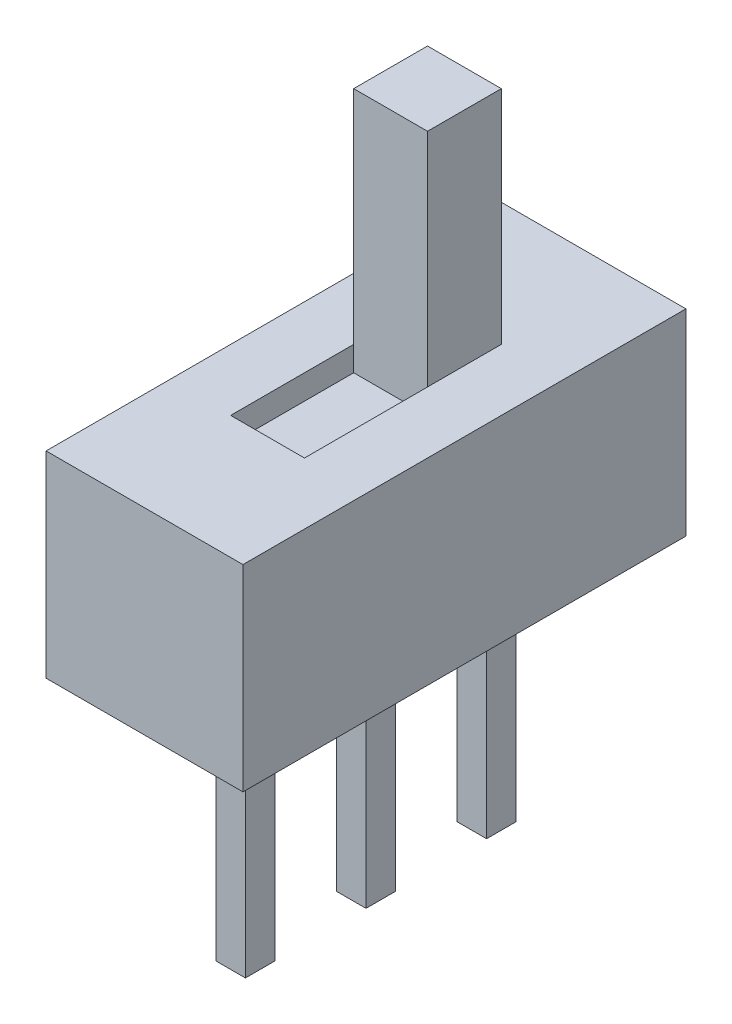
ISO-10303-21;
HEADER;
FILE_DESCRIPTION(('STEP AP214'),'2;1');
FILE_NAME('part.step','',(''),(''),'','','');
FILE_SCHEMA(('AUTOMOTIVE_DESIGN { 1 0 10303 214 1 1 1 1 }'));
ENDSEC;
DATA;
#1=APPLICATION_CONTEXT('core data for automotive mechanical design processes');
#2=APPLICATION_PROTOCOL_DEFINITION('international standard','automotive_design',2000,#1);
#3=PRODUCT_CONTEXT('',#1,'mechanical');
#4=PRODUCT('Part','Part','',(#3));
#5=PRODUCT_RELATED_PRODUCT_CATEGORY('part','',(#4));
#6=PRODUCT_DEFINITION_FORMATION('','',#4);
#7=PRODUCT_DEFINITION_CONTEXT('part definition',#1,'design');
#8=PRODUCT_DEFINITION('design','',#6,#7);
#9=PRODUCT_DEFINITION_SHAPE('','',#8);
#10=(LENGTH_UNIT() NAMED_UNIT(*) SI_UNIT(.MILLI.,.METRE.));
#11=(NAMED_UNIT(*) PLANE_ANGLE_UNIT() SI_UNIT($,.RADIAN.));
#12=(NAMED_UNIT(*) SI_UNIT($,.STERADIAN.) SOLID_ANGLE_UNIT());
#13=UNCERTAINTY_MEASURE_WITH_UNIT(LENGTH_MEASURE(1.E-05),#10,'distance_accuracy_value','');
#14=(GEOMETRIC_REPRESENTATION_CONTEXT(3) GLOBAL_UNCERTAINTY_ASSIGNED_CONTEXT((#13)) GLOBAL_UNIT_ASSIGNED_CONTEXT((#10,
#11,#12)) REPRESENTATION_CONTEXT('',''));
#15=CARTESIAN_POINT('',(0.,0.,0.));
#16=DIRECTION('',(0.,0.,1.));
#17=DIRECTION('',(1.,0.,0.));
#18=AXIS2_PLACEMENT_3D('',#15,#16,#17);
#19=CARTESIAN_POINT('',(0.,0.,9.));
#20=DIRECTION('',(0.,1.,0.));
#21=DIRECTION('',(0.,0.,1.));
#22=AXIS2_PLACEMENT_3D('',#19,#20,#21);
#23=PLANE('',#22);
#24=DIRECTION('',(1.,0.,0.));
#25=VECTOR('',#24,1.);
#26=CARTESIAN_POINT('',(1.7,0.,1.75));
#27=LINE('',#26,#25);
#28=CARTESIAN_POINT('',(1.7,0.,1.75));
#29=VERTEX_POINT('',#28);
#30=CARTESIAN_POINT('',(2.3,0.,1.75));
#31=VERTEX_POINT('',#30);
#32=EDGE_CURVE('E211',#29,#31,#27,.T.);
#33=ORIENTED_EDGE('',*,*,#32,.F.);
#34=DIRECTION('',(0.,0.,-1.));
#35=VECTOR('',#34,1.);
#36=CARTESIAN_POINT('',(1.7,0.,1.75));
#37=LINE('',#36,#35);
#38=CARTESIAN_POINT('',(1.7,0.,2.35));
#39=VERTEX_POINT('',#38);
#40=EDGE_CURVE('E224',#39,#29,#37,.T.);
#41=ORIENTED_EDGE('',*,*,#40,.F.);
#42=DIRECTION('',(-1.,0.,0.));
#43=VECTOR('',#42,1.);
#44=CARTESIAN_POINT('',(1.7,0.,2.35));
#45=LINE('',#44,#43);
#46=CARTESIAN_POINT('',(2.3,0.,2.35));
#47=VERTEX_POINT('',#46);
#48=EDGE_CURVE('E233',#47,#39,#45,.T.);
#49=ORIENTED_EDGE('',*,*,#48,.F.);
#50=DIRECTION('',(0.,0.,1.));
#51=VECTOR('',#50,1.);
#52=CARTESIAN_POINT('',(2.3,0.,1.75));
#53=LINE('',#52,#51);
#54=EDGE_CURVE('E214',#31,#47,#53,.T.);
#55=ORIENTED_EDGE('',*,*,#54,.F.);
#56=EDGE_LOOP('',(#33,#41,#49,#55));
#57=FACE_BOUND('',#56,.T.);
#58=DIRECTION('',(1.,0.,0.));
#59=VECTOR('',#58,1.);
#60=CARTESIAN_POINT('',(0.,0.,0.));
#61=LINE('',#60,#59);
#62=CARTESIAN_POINT('',(0.,0.,0.));
#63=VERTEX_POINT('',#62);
#64=CARTESIAN_POINT('',(4.,0.,0.));
#65=VERTEX_POINT('',#64);
#66=EDGE_CURVE('E355',#63,#65,#61,.T.);
#67=ORIENTED_EDGE('',*,*,#66,.T.);
#68=DIRECTION('',(0.,0.,-1.));
#69=VECTOR('',#68,1.);
#70=CARTESIAN_POINT('',(4.,0.,9.));
#71=LINE('',#70,#69);
#72=CARTESIAN_POINT('',(4.,0.,9.));
#73=VERTEX_POINT('',#72);
#74=EDGE_CURVE('E43',#73,#65,#71,.T.);
#75=ORIENTED_EDGE('',*,*,#74,.F.);
#76=DIRECTION('',(1.,0.,0.));
#77=VECTOR('',#76,1.);
#78=CARTESIAN_POINT('',(0.,0.,9.));
#79=LINE('',#78,#77);
#80=CARTESIAN_POINT('',(0.,0.,9.));
#81=VERTEX_POINT('',#80);
#82=EDGE_CURVE('E345',#81,#73,#79,.T.);
#83=ORIENTED_EDGE('',*,*,#82,.F.);
#84=DIRECTION('',(0.,0.,-1.));
#85=VECTOR('',#84,1.);
#86=CARTESIAN_POINT('',(0.,0.,9.));
#87=LINE('',#86,#85);
#88=EDGE_CURVE('E11',#81,#63,#87,.T.);
#89=ORIENTED_EDGE('',*,*,#88,.T.);
#90=EDGE_LOOP('',(#67,#75,#83,#89));
#91=FACE_BOUND('',#90,.T.);
#92=DIRECTION('',(0.,0.,-1.));
#93=VECTOR('',#92,1.);
#94=CARTESIAN_POINT('',(1.7,0.,7.25));
#95=LINE('',#94,#93);
#96=CARTESIAN_POINT('',(1.7,0.,7.25));
#97=VERTEX_POINT('',#96);
#98=CARTESIAN_POINT('',(1.7,0.,6.65));
#99=VERTEX_POINT('',#98);
#100=EDGE_CURVE('E249',#97,#99,#95,.T.);
#101=ORIENTED_EDGE('',*,*,#100,.F.);
#102=DIRECTION('',(-1.,0.,0.));
#103=VECTOR('',#102,1.);
#104=CARTESIAN_POINT('',(1.7,0.,7.25));
#105=LINE('',#104,#103);
#106=CARTESIAN_POINT('',(2.3,0.,7.25));
#107=VERTEX_POINT('',#106);
#108=EDGE_CURVE('E254',#107,#97,#105,.T.);
#109=ORIENTED_EDGE('',*,*,#108,.F.);
#110=DIRECTION('',(0.,0.,1.));
#111=VECTOR('',#110,1.);
#112=CARTESIAN_POINT('',(2.3,0.,7.25));
#113=LINE('',#112,#111);
#114=CARTESIAN_POINT('',(2.3,0.,6.65));
#115=VERTEX_POINT('',#114);
#116=EDGE_CURVE('E266',#115,#107,#113,.T.);
#117=ORIENTED_EDGE('',*,*,#116,.F.);
#118=DIRECTION('',(1.,0.,0.));
#119=VECTOR('',#118,1.);
#120=CARTESIAN_POINT('',(1.7,0.,6.65));
#121=LINE('',#120,#119);
#122=EDGE_CURVE('E263',#99,#115,#121,.T.);
#123=ORIENTED_EDGE('',*,*,#122,.F.);
#124=EDGE_LOOP('',(#101,#109,#117,#123));
#125=FACE_BOUND('',#124,.T.);
#126=DIRECTION('',(0.,0.,-1.));
#127=VECTOR('',#126,1.);
#128=CARTESIAN_POINT('',(1.7,0.,4.8));
#129=LINE('',#128,#127);
#130=CARTESIAN_POINT('',(1.7,0.,4.8));
#131=VERTEX_POINT('',#130);
#132=CARTESIAN_POINT('',(1.7,0.,4.2));
#133=VERTEX_POINT('',#132);
#134=EDGE_CURVE('E210',#131,#133,#129,.T.);
#135=ORIENTED_EDGE('',*,*,#134,.F.);
#136=DIRECTION('',(-1.,0.,0.));
#137=VECTOR('',#136,1.);
#138=CARTESIAN_POINT('',(1.7,0.,4.8));
#139=LINE('',#138,#137);
#140=CARTESIAN_POINT('',(2.3,0.,4.8));
#141=VERTEX_POINT('',#140);
#142=EDGE_CURVE('E207',#141,#131,#139,.T.);
#143=ORIENTED_EDGE('',*,*,#142,.F.);
#144=DIRECTION('',(0.,0.,1.));
#145=VECTOR('',#144,1.);
#146=CARTESIAN_POINT('',(2.3,0.,4.8));
#147=LINE('',#146,#145);
#148=CARTESIAN_POINT('',(2.3,0.,4.2));
#149=VERTEX_POINT('',#148);
#150=EDGE_CURVE('E55',#149,#141,#147,.T.);
#151=ORIENTED_EDGE('',*,*,#150,.F.);
#152=DIRECTION('',(1.,0.,0.));
#153=VECTOR('',#152,1.);
#154=CARTESIAN_POINT('',(1.7,0.,4.2));
#155=LINE('',#154,#153);
#156=EDGE_CURVE('E50',#133,#149,#155,.T.);
#157=ORIENTED_EDGE('',*,*,#156,.F.);
#158=EDGE_LOOP('',(#135,#143,#151,#157));
#159=FACE_BOUND('',#158,.T.);
#160=ADVANCED_FACE('F35',(#57,#91,#125,#159),#23,.F.);
#161=CARTESIAN_POINT('',(0.,4.,9.));
#162=DIRECTION('',(0.,-1.,0.));
#163=DIRECTION('',(0.,0.,-1.));
#164=AXIS2_PLACEMENT_3D('',#161,#162,#163);
#165=PLANE('',#164);
#166=DIRECTION('',(-1.,0.,0.));
#167=VECTOR('',#166,1.);
#168=CARTESIAN_POINT('',(0.,4.,0.));
#169=LINE('',#168,#167);
#170=CARTESIAN_POINT('',(4.,4.,0.));
#171=VERTEX_POINT('',#170);
#172=CARTESIAN_POINT('',(0.,4.,0.));
#173=VERTEX_POINT('',#172);
#174=EDGE_CURVE('E346',#171,#173,#169,.T.);
#175=ORIENTED_EDGE('',*,*,#174,.T.);
#176=DIRECTION('',(0.,0.,-1.));
#177=VECTOR('',#176,1.);
#178=CARTESIAN_POINT('',(0.,4.,9.));
#179=LINE('',#178,#177);
#180=CARTESIAN_POINT('',(0.,4.,9.));
#181=VERTEX_POINT('',#180);
#182=EDGE_CURVE('E352',#181,#173,#179,.T.);
#183=ORIENTED_EDGE('',*,*,#182,.F.);
#184=DIRECTION('',(-1.,0.,0.));
#185=VECTOR('',#184,1.);
#186=CARTESIAN_POINT('',(0.,4.,9.));
#187=LINE('',#186,#185);
#188=CARTESIAN_POINT('',(4.,4.,9.));
#189=VERTEX_POINT('',#188);
#190=EDGE_CURVE('E350',#189,#181,#187,.T.);
#191=ORIENTED_EDGE('',*,*,#190,.F.);
#192=DIRECTION('',(0.,0.,-1.));
#193=VECTOR('',#192,1.);
#194=CARTESIAN_POINT('',(4.,4.,9.));
#195=LINE('',#194,#193);
#196=EDGE_CURVE('E362',#189,#171,#195,.T.);
#197=ORIENTED_EDGE('',*,*,#196,.T.);
#198=EDGE_LOOP('',(#175,#183,#191,#197));
#199=FACE_BOUND('',#198,.T.);
#200=DIRECTION('',(1.,0.,0.));
#201=VECTOR('',#200,1.);
#202=CARTESIAN_POINT('',(1.25,4.,6.5));
#203=LINE('',#202,#201);
#204=CARTESIAN_POINT('',(1.25,4.,6.5));
#205=VERTEX_POINT('',#204);
#206=CARTESIAN_POINT('',(2.75,4.,6.5));
#207=VERTEX_POINT('',#206);
#208=EDGE_CURVE('E299',#205,#207,#203,.T.);
#209=ORIENTED_EDGE('',*,*,#208,.F.);
#210=DIRECTION('',(0.,0.,1.));
#211=VECTOR('',#210,1.);
#212=CARTESIAN_POINT('',(1.25,4.,4.));
#213=LINE('',#212,#211);
#214=CARTESIAN_POINT('',(1.25,4.,4.));
#215=VERTEX_POINT('',#214);
#216=EDGE_CURVE('E282',#215,#205,#213,.T.);
#217=ORIENTED_EDGE('',*,*,#216,.F.);
#218=DIRECTION('',(0.,0.,1.));
#219=VECTOR('',#218,1.);
#220=CARTESIAN_POINT('',(1.25,4.,2.5));
#221=LINE('',#220,#219);
#222=CARTESIAN_POINT('',(1.25,4.,2.5));
#223=VERTEX_POINT('',#222);
#224=EDGE_CURVE('E305',#223,#215,#221,.T.);
#225=ORIENTED_EDGE('',*,*,#224,.F.);
#226=DIRECTION('',(-1.,0.,0.));
#227=VECTOR('',#226,1.);
#228=CARTESIAN_POINT('',(1.25,4.,2.5));
#229=LINE('',#228,#227);
#230=CARTESIAN_POINT('',(2.75,4.,2.5));
#231=VERTEX_POINT('',#230);
#232=EDGE_CURVE('E316',#231,#223,#229,.T.);
#233=ORIENTED_EDGE('',*,*,#232,.F.);
#234=DIRECTION('',(0.,0.,-1.));
#235=VECTOR('',#234,1.);
#236=CARTESIAN_POINT('',(2.75,4.,2.5));
#237=LINE('',#236,#235);
#238=CARTESIAN_POINT('',(2.75,4.,4.));
#239=VERTEX_POINT('',#238);
#240=EDGE_CURVE('E325',#239,#231,#237,.T.);
#241=ORIENTED_EDGE('',*,*,#240,.F.);
#242=DIRECTION('',(0.,0.,-1.));
#243=VECTOR('',#242,1.);
#244=CARTESIAN_POINT('',(2.75,4.,4.));
#245=LINE('',#244,#243);
#246=EDGE_CURVE('E287',#207,#239,#245,.T.);
#247=ORIENTED_EDGE('',*,*,#246,.F.);
#248=EDGE_LOOP('',(#209,#217,#225,#233,#241,#247));
#249=FACE_BOUND('',#248,.T.);
#250=ADVANCED_FACE('F378',(#199,#249),#165,.F.);
#251=CARTESIAN_POINT('',(0.,0.,9.));
#252=DIRECTION('',(1.,0.,0.));
#253=DIRECTION('',(0.,0.,-1.));
#254=AXIS2_PLACEMENT_3D('',#251,#252,#253);
#255=PLANE('',#254);
#256=DIRECTION('',(0.,-1.,0.));
#257=VECTOR('',#256,1.);
#258=CARTESIAN_POINT('',(0.,0.,0.));
#259=LINE('',#258,#257);
#260=EDGE_CURVE('E341',#173,#63,#259,.T.);
#261=ORIENTED_EDGE('',*,*,#260,.T.);
#262=ORIENTED_EDGE('',*,*,#88,.F.);
#263=DIRECTION('',(0.,-1.,0.));
#264=VECTOR('',#263,1.);
#265=CARTESIAN_POINT('',(0.,0.,9.));
#266=LINE('',#265,#264);
#267=EDGE_CURVE('E342',#181,#81,#266,.T.);
#268=ORIENTED_EDGE('',*,*,#267,.F.);
#269=ORIENTED_EDGE('',*,*,#182,.T.);
#270=EDGE_LOOP('',(#261,#262,#268,#269));
#271=FACE_BOUND('',#270,.T.);
#272=ADVANCED_FACE('F37',(#271),#255,.F.);
#273=CARTESIAN_POINT('',(4.,0.,9.));
#274=DIRECTION('',(-1.,0.,0.));
#275=DIRECTION('',(0.,0.,1.));
#276=AXIS2_PLACEMENT_3D('',#273,#274,#275);
#277=PLANE('',#276);
#278=DIRECTION('',(0.,1.,0.));
#279=VECTOR('',#278,1.);
#280=CARTESIAN_POINT('',(4.,0.,0.));
#281=LINE('',#280,#279);
#282=EDGE_CURVE('E357',#65,#171,#281,.T.);
#283=ORIENTED_EDGE('',*,*,#282,.T.);
#284=ORIENTED_EDGE('',*,*,#196,.F.);
#285=DIRECTION('',(0.,1.,0.));
#286=VECTOR('',#285,1.);
#287=CARTESIAN_POINT('',(4.,0.,9.));
#288=LINE('',#287,#286);
#289=EDGE_CURVE('E348',#73,#189,#288,.T.);
#290=ORIENTED_EDGE('',*,*,#289,.F.);
#291=ORIENTED_EDGE('',*,*,#74,.T.);
#292=EDGE_LOOP('',(#283,#284,#290,#291));
#293=FACE_BOUND('',#292,.T.);
#294=ADVANCED_FACE('F369',(#293),#277,.F.);
#295=CARTESIAN_POINT('',(0.,0.,9.));
#296=DIRECTION('',(0.,0.,-1.));
#297=DIRECTION('',(-1.,0.,0.));
#298=AXIS2_PLACEMENT_3D('',#295,#296,#297);
#299=PLANE('',#298);
#300=ORIENTED_EDGE('',*,*,#267,.T.);
#301=ORIENTED_EDGE('',*,*,#82,.T.);
#302=ORIENTED_EDGE('',*,*,#289,.T.);
#303=ORIENTED_EDGE('',*,*,#190,.T.);
#304=EDGE_LOOP('',(#300,#301,#302,#303));
#305=FACE_BOUND('',#304,.T.);
#306=ADVANCED_FACE('F385',(#305),#299,.F.);
#307=CARTESIAN_POINT('',(0.,0.,0.));
#308=DIRECTION('',(0.,0.,-1.));
#309=DIRECTION('',(-1.,0.,0.));
#310=AXIS2_PLACEMENT_3D('',#307,#308,#309);
#311=PLANE('',#310);
#312=ORIENTED_EDGE('',*,*,#260,.F.);
#313=ORIENTED_EDGE('',*,*,#174,.F.);
#314=ORIENTED_EDGE('',*,*,#282,.F.);
#315=ORIENTED_EDGE('',*,*,#66,.F.);
#316=EDGE_LOOP('',(#312,#313,#314,#315));
#317=FACE_BOUND('',#316,.T.);
#318=ADVANCED_FACE('F375',(#317),#311,.T.);
#319=CARTESIAN_POINT('',(1.25,8.5,2.5));
#320=DIRECTION('',(1.,0.,0.));
#321=DIRECTION('',(0.,0.,-1.));
#322=AXIS2_PLACEMENT_3D('',#319,#320,#321);
#323=PLANE('',#322);
#324=ORIENTED_EDGE('',*,*,#224,.T.);
#325=DIRECTION('',(0.,-1.,0.));
#326=VECTOR('',#325,1.);
#327=CARTESIAN_POINT('',(1.25,8.5,4.));
#328=LINE('',#327,#326);
#329=CARTESIAN_POINT('',(1.25,8.5,4.));
#330=VERTEX_POINT('',#329);
#331=EDGE_CURVE('E338',#330,#215,#328,.T.);
#332=ORIENTED_EDGE('',*,*,#331,.F.);
#333=DIRECTION('',(0.,0.,1.));
#334=VECTOR('',#333,1.);
#335=CARTESIAN_POINT('',(1.25,8.5,2.5));
#336=LINE('',#335,#334);
#337=CARTESIAN_POINT('',(1.25,8.5,2.5));
#338=VERTEX_POINT('',#337);
#339=EDGE_CURVE('E312',#338,#330,#336,.T.);
#340=ORIENTED_EDGE('',*,*,#339,.F.);
#341=DIRECTION('',(0.,-1.,0.));
#342=VECTOR('',#341,1.);
#343=CARTESIAN_POINT('',(1.25,8.5,2.5));
#344=LINE('',#343,#342);
#345=EDGE_CURVE('E322',#338,#223,#344,.T.);
#346=ORIENTED_EDGE('',*,*,#345,.T.);
#347=EDGE_LOOP('',(#324,#332,#340,#346));
#348=FACE_BOUND('',#347,.T.);
#349=ADVANCED_FACE('F487',(#348),#323,.F.);
#350=CARTESIAN_POINT('',(1.25,8.5,4.));
#351=DIRECTION('',(0.,0.,-1.));
#352=DIRECTION('',(-1.,0.,0.));
#353=AXIS2_PLACEMENT_3D('',#350,#351,#352);
#354=PLANE('',#353);
#355=ORIENTED_EDGE('',*,*,#331,.T.);
#356=DIRECTION('',(0.,1.,0.));
#357=VECTOR('',#356,1.);
#358=CARTESIAN_POINT('',(1.25,3.5,4.));
#359=LINE('',#358,#357);
#360=CARTESIAN_POINT('',(1.25,3.5,4.));
#361=VERTEX_POINT('',#360);
#362=EDGE_CURVE('E303',#361,#215,#359,.T.);
#363=ORIENTED_EDGE('',*,*,#362,.F.);
#364=DIRECTION('',(-1.,0.,0.));
#365=VECTOR('',#364,1.);
#366=CARTESIAN_POINT('',(1.25,3.5,4.));
#367=LINE('',#366,#365);
#368=CARTESIAN_POINT('',(2.75,3.5,4.));
#369=VERTEX_POINT('',#368);
#370=EDGE_CURVE('E293',#369,#361,#367,.T.);
#371=ORIENTED_EDGE('',*,*,#370,.F.);
#372=DIRECTION('',(0.,1.,0.));
#373=VECTOR('',#372,1.);
#374=CARTESIAN_POINT('',(2.75,3.5,4.));
#375=LINE('',#374,#373);
#376=EDGE_CURVE('E306',#369,#239,#375,.T.);
#377=ORIENTED_EDGE('',*,*,#376,.T.);
#378=DIRECTION('',(0.,-1.,0.));
#379=VECTOR('',#378,1.);
#380=CARTESIAN_POINT('',(2.75,8.5,4.));
#381=LINE('',#380,#379);
#382=CARTESIAN_POINT('',(2.75,8.5,4.));
#383=VERTEX_POINT('',#382);
#384=EDGE_CURVE('E335',#383,#239,#381,.T.);
#385=ORIENTED_EDGE('',*,*,#384,.F.);
#386=DIRECTION('',(1.,0.,0.));
#387=VECTOR('',#386,1.);
#388=CARTESIAN_POINT('',(1.25,8.5,4.));
#389=LINE('',#388,#387);
#390=EDGE_CURVE('E315',#330,#383,#389,.T.);
#391=ORIENTED_EDGE('',*,*,#390,.F.);
#392=EDGE_LOOP('',(#355,#363,#371,#377,#385,#391));
#393=FACE_BOUND('',#392,.T.);
#394=ADVANCED_FACE('F483',(#393),#354,.F.);
#395=CARTESIAN_POINT('',(2.75,8.5,2.5));
#396=DIRECTION('',(-1.,0.,0.));
#397=DIRECTION('',(0.,0.,1.));
#398=AXIS2_PLACEMENT_3D('',#395,#396,#397);
#399=PLANE('',#398);
#400=ORIENTED_EDGE('',*,*,#240,.T.);
#401=DIRECTION('',(0.,-1.,0.));
#402=VECTOR('',#401,1.);
#403=CARTESIAN_POINT('',(2.75,8.5,2.5));
#404=LINE('',#403,#402);
#405=CARTESIAN_POINT('',(2.75,8.5,2.5));
#406=VERTEX_POINT('',#405);
#407=EDGE_CURVE('E332',#406,#231,#404,.T.);
#408=ORIENTED_EDGE('',*,*,#407,.F.);
#409=DIRECTION('',(0.,0.,-1.));
#410=VECTOR('',#409,1.);
#411=CARTESIAN_POINT('',(2.75,8.5,2.5));
#412=LINE('',#411,#410);
#413=EDGE_CURVE('E318',#383,#406,#412,.T.);
#414=ORIENTED_EDGE('',*,*,#413,.F.);
#415=ORIENTED_EDGE('',*,*,#384,.T.);
#416=EDGE_LOOP('',(#400,#408,#414,#415));
#417=FACE_BOUND('',#416,.T.);
#418=ADVANCED_FACE('F479',(#417),#399,.F.);
#419=CARTESIAN_POINT('',(1.25,8.5,2.5));
#420=DIRECTION('',(0.,0.,1.));
#421=DIRECTION('',(1.,0.,0.));
#422=AXIS2_PLACEMENT_3D('',#419,#420,#421);
#423=PLANE('',#422);
#424=ORIENTED_EDGE('',*,*,#232,.T.);
#425=ORIENTED_EDGE('',*,*,#345,.F.);
#426=DIRECTION('',(-1.,0.,0.));
#427=VECTOR('',#426,1.);
#428=CARTESIAN_POINT('',(1.25,8.5,2.5));
#429=LINE('',#428,#427);
#430=EDGE_CURVE('E320',#406,#338,#429,.T.);
#431=ORIENTED_EDGE('',*,*,#430,.F.);
#432=ORIENTED_EDGE('',*,*,#407,.T.);
#433=EDGE_LOOP('',(#424,#425,#431,#432));
#434=FACE_BOUND('',#433,.T.);
#435=ADVANCED_FACE('F475',(#434),#423,.F.);
#436=CARTESIAN_POINT('',(0.,8.5,0.));
#437=DIRECTION('',(0.,1.,0.));
#438=DIRECTION('',(0.,0.,1.));
#439=AXIS2_PLACEMENT_3D('',#436,#437,#438);
#440=PLANE('',#439);
#441=ORIENTED_EDGE('',*,*,#339,.T.);
#442=ORIENTED_EDGE('',*,*,#390,.T.);
#443=ORIENTED_EDGE('',*,*,#413,.T.);
#444=ORIENTED_EDGE('',*,*,#430,.T.);
#445=EDGE_LOOP('',(#441,#442,#443,#444));
#446=FACE_BOUND('',#445,.T.);
#447=ADVANCED_FACE('F471',(#446),#440,.T.);
#448=CARTESIAN_POINT('',(1.25,3.5,4.));
#449=DIRECTION('',(-1.,0.,0.));
#450=DIRECTION('',(0.,0.,1.));
#451=AXIS2_PLACEMENT_3D('',#448,#449,#450);
#452=PLANE('',#451);
#453=ORIENTED_EDGE('',*,*,#216,.T.);
#454=DIRECTION('',(0.,1.,0.));
#455=VECTOR('',#454,1.);
#456=CARTESIAN_POINT('',(1.25,3.5,6.5));
#457=LINE('',#456,#455);
#458=CARTESIAN_POINT('',(1.25,3.5,6.5));
#459=VERTEX_POINT('',#458);
#460=EDGE_CURVE('E296',#459,#205,#457,.T.);
#461=ORIENTED_EDGE('',*,*,#460,.F.);
#462=DIRECTION('',(0.,0.,1.));
#463=VECTOR('',#462,1.);
#464=CARTESIAN_POINT('',(1.25,3.5,4.));
#465=LINE('',#464,#463);
#466=EDGE_CURVE('E283',#361,#459,#465,.T.);
#467=ORIENTED_EDGE('',*,*,#466,.F.);
#468=ORIENTED_EDGE('',*,*,#362,.T.);
#469=EDGE_LOOP('',(#453,#461,#467,#468));
#470=FACE_BOUND('',#469,.T.);
#471=ADVANCED_FACE('F464',(#470),#452,.F.);
#472=CARTESIAN_POINT('',(2.75,3.5,4.));
#473=DIRECTION('',(1.,0.,0.));
#474=DIRECTION('',(0.,0.,-1.));
#475=AXIS2_PLACEMENT_3D('',#472,#473,#474);
#476=PLANE('',#475);
#477=ORIENTED_EDGE('',*,*,#246,.T.);
#478=ORIENTED_EDGE('',*,*,#376,.F.);
#479=DIRECTION('',(0.,0.,-1.));
#480=VECTOR('',#479,1.);
#481=CARTESIAN_POINT('',(2.75,3.5,4.));
#482=LINE('',#481,#480);
#483=CARTESIAN_POINT('',(2.75,3.5,6.5));
#484=VERTEX_POINT('',#483);
#485=EDGE_CURVE('E290',#484,#369,#482,.T.);
#486=ORIENTED_EDGE('',*,*,#485,.F.);
#487=DIRECTION('',(0.,1.,0.));
#488=VECTOR('',#487,1.);
#489=CARTESIAN_POINT('',(2.75,3.5,6.5));
#490=LINE('',#489,#488);
#491=EDGE_CURVE('E309',#484,#207,#490,.T.);
#492=ORIENTED_EDGE('',*,*,#491,.T.);
#493=EDGE_LOOP('',(#477,#478,#486,#492));
#494=FACE_BOUND('',#493,.T.);
#495=ADVANCED_FACE('F461',(#494),#476,.F.);
#496=CARTESIAN_POINT('',(1.25,3.5,6.5));
#497=DIRECTION('',(0.,0.,1.));
#498=DIRECTION('',(1.,0.,0.));
#499=AXIS2_PLACEMENT_3D('',#496,#497,#498);
#500=PLANE('',#499);
#501=ORIENTED_EDGE('',*,*,#208,.T.);
#502=ORIENTED_EDGE('',*,*,#491,.F.);
#503=DIRECTION('',(1.,0.,0.));
#504=VECTOR('',#503,1.);
#505=CARTESIAN_POINT('',(1.25,3.5,6.5));
#506=LINE('',#505,#504);
#507=EDGE_CURVE('E286',#459,#484,#506,.T.);
#508=ORIENTED_EDGE('',*,*,#507,.F.);
#509=ORIENTED_EDGE('',*,*,#460,.T.);
#510=EDGE_LOOP('',(#501,#502,#508,#509));
#511=FACE_BOUND('',#510,.T.);
#512=ADVANCED_FACE('F459',(#511),#500,.F.);
#513=CARTESIAN_POINT('',(0.,3.5,0.));
#514=DIRECTION('',(0.,1.,0.));
#515=DIRECTION('',(0.,0.,1.));
#516=AXIS2_PLACEMENT_3D('',#513,#514,#515);
#517=PLANE('',#516);
#518=ORIENTED_EDGE('',*,*,#466,.T.);
#519=ORIENTED_EDGE('',*,*,#507,.T.);
#520=ORIENTED_EDGE('',*,*,#485,.T.);
#521=ORIENTED_EDGE('',*,*,#370,.T.);
#522=EDGE_LOOP('',(#518,#519,#520,#521));
#523=FACE_BOUND('',#522,.T.);
#524=ADVANCED_FACE('F455',(#523),#517,.T.);
#525=CARTESIAN_POINT('',(1.7,-5.,7.25));
#526=DIRECTION('',(1.,0.,0.));
#527=DIRECTION('',(0.,0.,-1.));
#528=AXIS2_PLACEMENT_3D('',#525,#526,#527);
#529=PLANE('',#528);
#530=ORIENTED_EDGE('',*,*,#100,.T.);
#531=DIRECTION('',(0.,1.,0.));
#532=VECTOR('',#531,1.);
#533=CARTESIAN_POINT('',(1.7,-5.,6.65));
#534=LINE('',#533,#532);
#535=CARTESIAN_POINT('',(1.7,-5.,6.65));
#536=VERTEX_POINT('',#535);
#537=EDGE_CURVE('E279',#536,#99,#534,.T.);
#538=ORIENTED_EDGE('',*,*,#537,.F.);
#539=DIRECTION('',(0.,0.,-1.));
#540=VECTOR('',#539,1.);
#541=CARTESIAN_POINT('',(1.7,-5.,7.25));
#542=LINE('',#541,#540);
#543=CARTESIAN_POINT('',(1.7,-5.,7.25));
#544=VERTEX_POINT('',#543);
#545=EDGE_CURVE('E250',#544,#536,#542,.T.);
#546=ORIENTED_EDGE('',*,*,#545,.F.);
#547=DIRECTION('',(0.,1.,0.));
#548=VECTOR('',#547,1.);
#549=CARTESIAN_POINT('',(1.7,-5.,7.25));
#550=LINE('',#549,#548);
#551=EDGE_CURVE('E260',#544,#97,#550,.T.);
#552=ORIENTED_EDGE('',*,*,#551,.T.);
#553=EDGE_LOOP('',(#530,#538,#546,#552));
#554=FACE_BOUND('',#553,.T.);
#555=ADVANCED_FACE('F451',(#554),#529,.F.);
#556=CARTESIAN_POINT('',(1.7,-5.,6.65));
#557=DIRECTION('',(0.,0.,1.));
#558=DIRECTION('',(1.,0.,0.));
#559=AXIS2_PLACEMENT_3D('',#556,#557,#558);
#560=PLANE('',#559);
#561=ORIENTED_EDGE('',*,*,#122,.T.);
#562=DIRECTION('',(0.,1.,0.));
#563=VECTOR('',#562,1.);
#564=CARTESIAN_POINT('',(2.3,-5.,6.65));
#565=LINE('',#564,#563);
#566=CARTESIAN_POINT('',(2.3,-5.,6.65));
#567=VERTEX_POINT('',#566);
#568=EDGE_CURVE('E276',#567,#115,#565,.T.);
#569=ORIENTED_EDGE('',*,*,#568,.F.);
#570=DIRECTION('',(1.,0.,0.));
#571=VECTOR('',#570,1.);
#572=CARTESIAN_POINT('',(1.7,-5.,6.65));
#573=LINE('',#572,#571);
#574=EDGE_CURVE('E253',#536,#567,#573,.T.);
#575=ORIENTED_EDGE('',*,*,#574,.F.);
#576=ORIENTED_EDGE('',*,*,#537,.T.);
#577=EDGE_LOOP('',(#561,#569,#575,#576));
#578=FACE_BOUND('',#577,.T.);
#579=ADVANCED_FACE('F447',(#578),#560,.F.);
#580=CARTESIAN_POINT('',(2.3,-5.,7.25));
#581=DIRECTION('',(-1.,0.,0.));
#582=DIRECTION('',(0.,0.,1.));
#583=AXIS2_PLACEMENT_3D('',#580,#581,#582);
#584=PLANE('',#583);
#585=ORIENTED_EDGE('',*,*,#116,.T.);
#586=DIRECTION('',(0.,1.,0.));
#587=VECTOR('',#586,1.);
#588=CARTESIAN_POINT('',(2.3,-5.,7.25));
#589=LINE('',#588,#587);
#590=CARTESIAN_POINT('',(2.3,-5.,7.25));
#591=VERTEX_POINT('',#590);
#592=EDGE_CURVE('E273',#591,#107,#589,.T.);
#593=ORIENTED_EDGE('',*,*,#592,.F.);
#594=DIRECTION('',(0.,0.,1.));
#595=VECTOR('',#594,1.);
#596=CARTESIAN_POINT('',(2.3,-5.,7.25));
#597=LINE('',#596,#595);
#598=EDGE_CURVE('E256',#567,#591,#597,.T.);
#599=ORIENTED_EDGE('',*,*,#598,.F.);
#600=ORIENTED_EDGE('',*,*,#568,.T.);
#601=EDGE_LOOP('',(#585,#593,#599,#600));
#602=FACE_BOUND('',#601,.T.);
#603=ADVANCED_FACE('F443',(#602),#584,.F.);
#604=CARTESIAN_POINT('',(1.7,-5.,7.25));
#605=DIRECTION('',(0.,0.,-1.));
#606=DIRECTION('',(-1.,0.,0.));
#607=AXIS2_PLACEMENT_3D('',#604,#605,#606);
#608=PLANE('',#607);
#609=ORIENTED_EDGE('',*,*,#108,.T.);
#610=ORIENTED_EDGE('',*,*,#551,.F.);
#611=DIRECTION('',(-1.,0.,0.));
#612=VECTOR('',#611,1.);
#613=CARTESIAN_POINT('',(1.7,-5.,7.25));
#614=LINE('',#613,#612);
#615=EDGE_CURVE('E258',#591,#544,#614,.T.);
#616=ORIENTED_EDGE('',*,*,#615,.F.);
#617=ORIENTED_EDGE('',*,*,#592,.T.);
#618=EDGE_LOOP('',(#609,#610,#616,#617));
#619=FACE_BOUND('',#618,.T.);
#620=ADVANCED_FACE('F439',(#619),#608,.F.);
#621=CARTESIAN_POINT('',(0.,-5.,0.));
#622=DIRECTION('',(0.,-1.,0.));
#623=DIRECTION('',(0.,0.,-1.));
#624=AXIS2_PLACEMENT_3D('',#621,#622,#623);
#625=PLANE('',#624);
#626=ORIENTED_EDGE('',*,*,#545,.T.);
#627=ORIENTED_EDGE('',*,*,#574,.T.);
#628=ORIENTED_EDGE('',*,*,#598,.T.);
#629=ORIENTED_EDGE('',*,*,#615,.T.);
#630=EDGE_LOOP('',(#626,#627,#628,#629));
#631=FACE_BOUND('',#630,.T.);
#632=ADVANCED_FACE('F435',(#631),#625,.T.);
#633=CARTESIAN_POINT('',(1.7,-5.,1.75));
#634=DIRECTION('',(0.,0.,1.));
#635=DIRECTION('',(1.,0.,0.));
#636=AXIS2_PLACEMENT_3D('',#633,#634,#635);
#637=PLANE('',#636);
#638=ORIENTED_EDGE('',*,*,#32,.T.);
#639=DIRECTION('',(0.,1.,0.));
#640=VECTOR('',#639,1.);
#641=CARTESIAN_POINT('',(2.3,-5.,1.75));
#642=LINE('',#641,#640);
#643=CARTESIAN_POINT('',(2.3,-5.,1.75));
#644=VERTEX_POINT('',#643);
#645=EDGE_CURVE('E246',#644,#31,#642,.T.);
#646=ORIENTED_EDGE('',*,*,#645,.F.);
#647=DIRECTION('',(1.,0.,0.));
#648=VECTOR('',#647,1.);
#649=CARTESIAN_POINT('',(1.7,-5.,1.75));
#650=LINE('',#649,#648);
#651=CARTESIAN_POINT('',(1.7,-5.,1.75));
#652=VERTEX_POINT('',#651);
#653=EDGE_CURVE('E220',#652,#644,#650,.T.);
#654=ORIENTED_EDGE('',*,*,#653,.F.);
#655=DIRECTION('',(0.,1.,0.));
#656=VECTOR('',#655,1.);
#657=CARTESIAN_POINT('',(1.7,-5.,1.75));
#658=LINE('',#657,#656);
#659=EDGE_CURVE('E229',#652,#29,#658,.T.);
#660=ORIENTED_EDGE('',*,*,#659,.T.);
#661=EDGE_LOOP('',(#638,#646,#654,#660));
#662=FACE_BOUND('',#661,.T.);
#663=ADVANCED_FACE('F431',(#662),#637,.F.);
#664=CARTESIAN_POINT('',(2.3,-5.,1.75));
#665=DIRECTION('',(-1.,0.,0.));
#666=DIRECTION('',(0.,0.,1.));
#667=AXIS2_PLACEMENT_3D('',#664,#665,#666);
#668=PLANE('',#667);
#669=ORIENTED_EDGE('',*,*,#54,.T.);
#670=DIRECTION('',(0.,1.,0.));
#671=VECTOR('',#670,1.);
#672=CARTESIAN_POINT('',(2.3,-5.,2.35));
#673=LINE('',#672,#671);
#674=CARTESIAN_POINT('',(2.3,-5.,2.35));
#675=VERTEX_POINT('',#674);
#676=EDGE_CURVE('E243',#675,#47,#673,.T.);
#677=ORIENTED_EDGE('',*,*,#676,.F.);
#678=DIRECTION('',(0.,0.,1.));
#679=VECTOR('',#678,1.);
#680=CARTESIAN_POINT('',(2.3,-5.,1.75));
#681=LINE('',#680,#679);
#682=EDGE_CURVE('E223',#644,#675,#681,.T.);
#683=ORIENTED_EDGE('',*,*,#682,.F.);
#684=ORIENTED_EDGE('',*,*,#645,.T.);
#685=EDGE_LOOP('',(#669,#677,#683,#684));
#686=FACE_BOUND('',#685,.T.);
#687=ADVANCED_FACE('F427',(#686),#668,.F.);
#688=CARTESIAN_POINT('',(1.7,-5.,2.35));
#689=DIRECTION('',(0.,0.,-1.));
#690=DIRECTION('',(-1.,0.,0.));
#691=AXIS2_PLACEMENT_3D('',#688,#689,#690);
#692=PLANE('',#691);
#693=ORIENTED_EDGE('',*,*,#48,.T.);
#694=DIRECTION('',(0.,1.,0.));
#695=VECTOR('',#694,1.);
#696=CARTESIAN_POINT('',(1.7,-5.,2.35));
#697=LINE('',#696,#695);
#698=CARTESIAN_POINT('',(1.7,-5.,2.35));
#699=VERTEX_POINT('',#698);
#700=EDGE_CURVE('E240',#699,#39,#697,.T.);
#701=ORIENTED_EDGE('',*,*,#700,.F.);
#702=DIRECTION('',(-1.,0.,0.));
#703=VECTOR('',#702,1.);
#704=CARTESIAN_POINT('',(1.7,-5.,2.35));
#705=LINE('',#704,#703);
#706=EDGE_CURVE('E226',#675,#699,#705,.T.);
#707=ORIENTED_EDGE('',*,*,#706,.F.);
#708=ORIENTED_EDGE('',*,*,#676,.T.);
#709=EDGE_LOOP('',(#693,#701,#707,#708));
#710=FACE_BOUND('',#709,.T.);
#711=ADVANCED_FACE('F423',(#710),#692,.F.);
#712=CARTESIAN_POINT('',(1.7,-5.,1.75));
#713=DIRECTION('',(1.,0.,0.));
#714=DIRECTION('',(0.,0.,-1.));
#715=AXIS2_PLACEMENT_3D('',#712,#713,#714);
#716=PLANE('',#715);
#717=ORIENTED_EDGE('',*,*,#40,.T.);
#718=ORIENTED_EDGE('',*,*,#659,.F.);
#719=DIRECTION('',(0.,0.,-1.));
#720=VECTOR('',#719,1.);
#721=CARTESIAN_POINT('',(1.7,-5.,1.75));
#722=LINE('',#721,#720);
#723=EDGE_CURVE('E228',#699,#652,#722,.T.);
#724=ORIENTED_EDGE('',*,*,#723,.F.);
#725=ORIENTED_EDGE('',*,*,#700,.T.);
#726=EDGE_LOOP('',(#717,#718,#724,#725));
#727=FACE_BOUND('',#726,.T.);
#728=ADVANCED_FACE('F419',(#727),#716,.F.);
#729=CARTESIAN_POINT('',(0.,-5.,0.));
#730=DIRECTION('',(0.,-1.,0.));
#731=DIRECTION('',(0.,0.,-1.));
#732=AXIS2_PLACEMENT_3D('',#729,#730,#731);
#733=PLANE('',#732);
#734=ORIENTED_EDGE('',*,*,#653,.T.);
#735=ORIENTED_EDGE('',*,*,#682,.T.);
#736=ORIENTED_EDGE('',*,*,#706,.T.);
#737=ORIENTED_EDGE('',*,*,#723,.T.);
#738=EDGE_LOOP('',(#734,#735,#736,#737));
#739=FACE_BOUND('',#738,.T.);
#740=ADVANCED_FACE('F416',(#739),#733,.T.);
#741=CARTESIAN_POINT('',(1.7,-5.,4.8));
#742=DIRECTION('',(1.,0.,0.));
#743=DIRECTION('',(0.,0.,-1.));
#744=AXIS2_PLACEMENT_3D('',#741,#742,#743);
#745=PLANE('',#744);
#746=ORIENTED_EDGE('',*,*,#134,.T.);
#747=DIRECTION('',(0.,1.,0.));
#748=VECTOR('',#747,1.);
#749=CARTESIAN_POINT('',(1.7,-5.,4.2));
#750=LINE('',#749,#748);
#751=CARTESIAN_POINT('',(1.7,-5.,4.2));
#752=VERTEX_POINT('',#751);
#753=EDGE_CURVE('E191',#752,#133,#750,.T.);
#754=ORIENTED_EDGE('',*,*,#753,.F.);
#755=DIRECTION('',(0.,0.,-1.));
#756=VECTOR('',#755,1.);
#757=CARTESIAN_POINT('',(1.7,-5.,4.8));
#758=LINE('',#757,#756);
#759=CARTESIAN_POINT('',(1.7,-5.,4.8));
#760=VERTEX_POINT('',#759);
#761=EDGE_CURVE('E198',#760,#752,#758,.T.);
#762=ORIENTED_EDGE('',*,*,#761,.F.);
#763=DIRECTION('',(0.,1.,0.));
#764=VECTOR('',#763,1.);
#765=CARTESIAN_POINT('',(1.7,-5.,4.8));
#766=LINE('',#765,#764);
#767=EDGE_CURVE('E394',#760,#131,#766,.T.);
#768=ORIENTED_EDGE('',*,*,#767,.T.);
#769=EDGE_LOOP('',(#746,#754,#762,#768));
#770=FACE_BOUND('',#769,.T.);
#771=ADVANCED_FACE('F209',(#770),#745,.F.);
#772=CARTESIAN_POINT('',(1.7,-5.,4.2));
#773=DIRECTION('',(0.,0.,1.));
#774=DIRECTION('',(1.,0.,0.));
#775=AXIS2_PLACEMENT_3D('',#772,#773,#774);
#776=PLANE('',#775);
#777=ORIENTED_EDGE('',*,*,#156,.T.);
#778=DIRECTION('',(0.,1.,0.));
#779=VECTOR('',#778,1.);
#780=CARTESIAN_POINT('',(2.3,-5.,4.2));
#781=LINE('',#780,#779);
#782=CARTESIAN_POINT('',(2.3,-5.,4.2));
#783=VERTEX_POINT('',#782);
#784=EDGE_CURVE('E194',#783,#149,#781,.T.);
#785=ORIENTED_EDGE('',*,*,#784,.F.);
#786=DIRECTION('',(1.,0.,0.));
#787=VECTOR('',#786,1.);
#788=CARTESIAN_POINT('',(1.7,-5.,4.2));
#789=LINE('',#788,#787);
#790=EDGE_CURVE('E187',#752,#783,#789,.T.);
#791=ORIENTED_EDGE('',*,*,#790,.F.);
#792=ORIENTED_EDGE('',*,*,#753,.T.);
#793=EDGE_LOOP('',(#777,#785,#791,#792));
#794=FACE_BOUND('',#793,.T.);
#795=ADVANCED_FACE('F189',(#794),#776,.F.);
#796=CARTESIAN_POINT('',(2.3,-5.,4.8));
#797=DIRECTION('',(-1.,0.,0.));
#798=DIRECTION('',(0.,0.,1.));
#799=AXIS2_PLACEMENT_3D('',#796,#797,#798);
#800=PLANE('',#799);
#801=ORIENTED_EDGE('',*,*,#150,.T.);
#802=DIRECTION('',(0.,1.,0.));
#803=VECTOR('',#802,1.);
#804=CARTESIAN_POINT('',(2.3,-5.,4.8));
#805=LINE('',#804,#803);
#806=CARTESIAN_POINT('',(2.3,-5.,4.8));
#807=VERTEX_POINT('',#806);
#808=EDGE_CURVE('E216',#807,#141,#805,.T.);
#809=ORIENTED_EDGE('',*,*,#808,.F.);
#810=DIRECTION('',(0.,0.,1.));
#811=VECTOR('',#810,1.);
#812=CARTESIAN_POINT('',(2.3,-5.,4.8));
#813=LINE('',#812,#811);
#814=EDGE_CURVE('E197',#783,#807,#813,.T.);
#815=ORIENTED_EDGE('',*,*,#814,.F.);
#816=ORIENTED_EDGE('',*,*,#784,.T.);
#817=EDGE_LOOP('',(#801,#809,#815,#816));
#818=FACE_BOUND('',#817,.T.);
#819=ADVANCED_FACE('F403',(#818),#800,.F.);
#820=CARTESIAN_POINT('',(1.7,-5.,4.8));
#821=DIRECTION('',(0.,0.,-1.));
#822=DIRECTION('',(-1.,0.,0.));
#823=AXIS2_PLACEMENT_3D('',#820,#821,#822);
#824=PLANE('',#823);
#825=ORIENTED_EDGE('',*,*,#142,.T.);
#826=ORIENTED_EDGE('',*,*,#767,.F.);
#827=DIRECTION('',(-1.,0.,0.));
#828=VECTOR('',#827,1.);
#829=CARTESIAN_POINT('',(1.7,-5.,4.8));
#830=LINE('',#829,#828);
#831=EDGE_CURVE('E203',#807,#760,#830,.T.);
#832=ORIENTED_EDGE('',*,*,#831,.F.);
#833=ORIENTED_EDGE('',*,*,#808,.T.);
#834=EDGE_LOOP('',(#825,#826,#832,#833));
#835=FACE_BOUND('',#834,.T.);
#836=ADVANCED_FACE('F393',(#835),#824,.F.);
#837=CARTESIAN_POINT('',(0.,-5.,0.));
#838=DIRECTION('',(0.,-1.,0.));
#839=DIRECTION('',(0.,0.,-1.));
#840=AXIS2_PLACEMENT_3D('',#837,#838,#839);
#841=PLANE('',#840);
#842=ORIENTED_EDGE('',*,*,#761,.T.);
#843=ORIENTED_EDGE('',*,*,#790,.T.);
#844=ORIENTED_EDGE('',*,*,#814,.T.);
#845=ORIENTED_EDGE('',*,*,#831,.T.);
#846=EDGE_LOOP('',(#842,#843,#844,#845));
#847=FACE_BOUND('',#846,.T.);
#848=ADVANCED_FACE('F201',(#847),#841,.T.);
#849=CLOSED_SHELL('',(#160,#250,#272,#294,#306,#318,#349,#394,#418,#435,#447,#471,#495,#512,
#524,#555,#579,#603,#620,#632,#663,#687,#711,#728,#740,#771,#795,#819,#836,#848));
#850=MANIFOLD_SOLID_BREP('B2',#849);
#851=ADVANCED_BREP_SHAPE_REPRESENTATION('',(#18,#850),#14);
#852=SHAPE_DEFINITION_REPRESENTATION(#9,#851);
ENDSEC;
END-ISO-10303-21;
